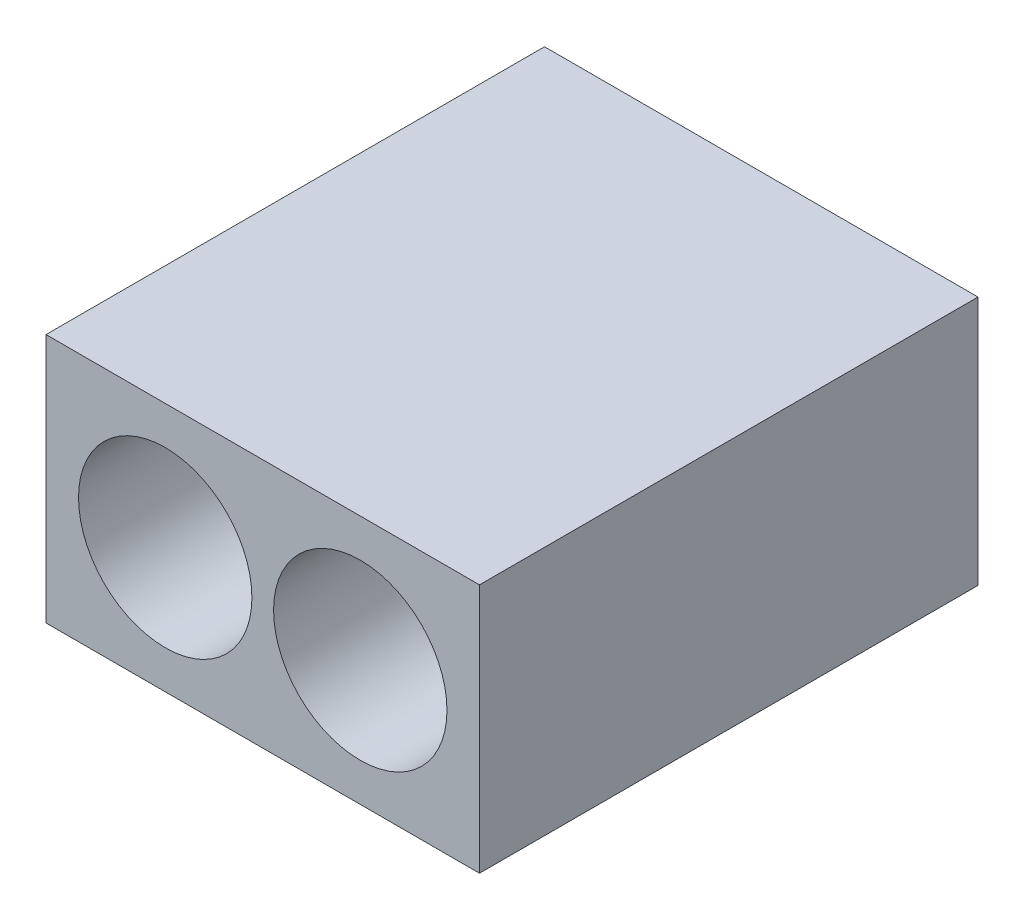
ISO-10303-21;
HEADER;
FILE_DESCRIPTION(('STEP AP214'),'2;1');
FILE_NAME('part.step','',(''),(''),'','','');
FILE_SCHEMA(('AUTOMOTIVE_DESIGN { 1 0 10303 214 1 1 1 1 }'));
ENDSEC;
DATA;
#1=APPLICATION_CONTEXT('core data for automotive mechanical design processes');
#2=APPLICATION_PROTOCOL_DEFINITION('international standard','automotive_design',2000,#1);
#3=PRODUCT_CONTEXT('',#1,'mechanical');
#4=PRODUCT('Part','Part','',(#3));
#5=PRODUCT_RELATED_PRODUCT_CATEGORY('part','',(#4));
#6=PRODUCT_DEFINITION_FORMATION('','',#4);
#7=PRODUCT_DEFINITION_CONTEXT('part definition',#1,'design');
#8=PRODUCT_DEFINITION('design','',#6,#7);
#9=PRODUCT_DEFINITION_SHAPE('','',#8);
#10=(LENGTH_UNIT() NAMED_UNIT(*) SI_UNIT(.MILLI.,.METRE.));
#11=(NAMED_UNIT(*) PLANE_ANGLE_UNIT() SI_UNIT($,.RADIAN.));
#12=(NAMED_UNIT(*) SI_UNIT($,.STERADIAN.) SOLID_ANGLE_UNIT());
#13=UNCERTAINTY_MEASURE_WITH_UNIT(LENGTH_MEASURE(1.E-05),#10,'distance_accuracy_value','');
#14=(GEOMETRIC_REPRESENTATION_CONTEXT(3) GLOBAL_UNCERTAINTY_ASSIGNED_CONTEXT((#13)) GLOBAL_UNIT_ASSIGNED_CONTEXT((#10,
#11,#12)) REPRESENTATION_CONTEXT('',''));
#15=CARTESIAN_POINT('',(0.,0.,0.));
#16=DIRECTION('',(0.,0.,1.));
#17=DIRECTION('',(1.,0.,0.));
#18=AXIS2_PLACEMENT_3D('',#15,#16,#17);
#19=CARTESIAN_POINT('',(10.,-5.762,23.));
#20=DIRECTION('',(-1.,0.,0.));
#21=DIRECTION('',(0.,0.,1.));
#22=AXIS2_PLACEMENT_3D('',#19,#20,#21);
#23=PLANE('',#22);
#24=DIRECTION('',(0.,1.,0.));
#25=VECTOR('',#24,1.);
#26=CARTESIAN_POINT('',(10.,-5.762,0.));
#27=LINE('',#26,#25);
#28=CARTESIAN_POINT('',(10.,-5.762,0.));
#29=VERTEX_POINT('',#28);
#30=CARTESIAN_POINT('',(10.,5.762,0.));
#31=VERTEX_POINT('',#30);
#32=EDGE_CURVE('E97',#29,#31,#27,.T.);
#33=ORIENTED_EDGE('',*,*,#32,.T.);
#34=DIRECTION('',(0.,0.,-1.));
#35=VECTOR('',#34,1.);
#36=CARTESIAN_POINT('',(10.,5.762,23.));
#37=LINE('',#36,#35);
#38=CARTESIAN_POINT('',(10.,5.762,23.));
#39=VERTEX_POINT('',#38);
#40=EDGE_CURVE('E11',#39,#31,#37,.T.);
#41=ORIENTED_EDGE('',*,*,#40,.F.);
#42=DIRECTION('',(0.,1.,0.));
#43=VECTOR('',#42,1.);
#44=CARTESIAN_POINT('',(10.,-5.762,23.));
#45=LINE('',#44,#43);
#46=CARTESIAN_POINT('',(10.,-5.762,23.));
#47=VERTEX_POINT('',#46);
#48=EDGE_CURVE('E85',#47,#39,#45,.T.);
#49=ORIENTED_EDGE('',*,*,#48,.F.);
#50=DIRECTION('',(0.,0.,-1.));
#51=VECTOR('',#50,1.);
#52=CARTESIAN_POINT('',(10.,-5.762,23.));
#53=LINE('',#52,#51);
#54=EDGE_CURVE('E93',#47,#29,#53,.T.);
#55=ORIENTED_EDGE('',*,*,#54,.T.);
#56=EDGE_LOOP('',(#33,#41,#49,#55));
#57=FACE_BOUND('',#56,.T.);
#58=ADVANCED_FACE('F34',(#57),#23,.F.);
#59=CARTESIAN_POINT('',(-10.,5.762,23.));
#60=DIRECTION('',(0.,-1.,0.));
#61=DIRECTION('',(0.,0.,-1.));
#62=AXIS2_PLACEMENT_3D('',#59,#60,#61);
#63=PLANE('',#62);
#64=DIRECTION('',(-1.,0.,0.));
#65=VECTOR('',#64,1.);
#66=CARTESIAN_POINT('',(-10.,5.762,0.));
#67=LINE('',#66,#65);
#68=CARTESIAN_POINT('',(-10.,5.762,0.));
#69=VERTEX_POINT('',#68);
#70=EDGE_CURVE('E89',#31,#69,#67,.T.);
#71=ORIENTED_EDGE('',*,*,#70,.T.);
#72=DIRECTION('',(0.,0.,-1.));
#73=VECTOR('',#72,1.);
#74=CARTESIAN_POINT('',(-10.,5.762,23.));
#75=LINE('',#74,#73);
#76=CARTESIAN_POINT('',(-10.,5.762,23.));
#77=VERTEX_POINT('',#76);
#78=EDGE_CURVE('E42',#77,#69,#75,.T.);
#79=ORIENTED_EDGE('',*,*,#78,.F.);
#80=DIRECTION('',(-1.,0.,0.));
#81=VECTOR('',#80,1.);
#82=CARTESIAN_POINT('',(-10.,5.762,23.));
#83=LINE('',#82,#81);
#84=EDGE_CURVE('E80',#39,#77,#83,.T.);
#85=ORIENTED_EDGE('',*,*,#84,.F.);
#86=ORIENTED_EDGE('',*,*,#40,.T.);
#87=EDGE_LOOP('',(#71,#79,#85,#86));
#88=FACE_BOUND('',#87,.T.);
#89=ADVANCED_FACE('F88',(#88),#63,.F.);
#90=CARTESIAN_POINT('',(-10.,-5.762,23.));
#91=DIRECTION('',(1.,0.,0.));
#92=DIRECTION('',(0.,0.,-1.));
#93=AXIS2_PLACEMENT_3D('',#90,#91,#92);
#94=PLANE('',#93);
#95=DIRECTION('',(0.,-1.,0.));
#96=VECTOR('',#95,1.);
#97=CARTESIAN_POINT('',(-10.,-5.762,0.));
#98=LINE('',#97,#96);
#99=CARTESIAN_POINT('',(-10.,-5.762,0.));
#100=VERTEX_POINT('',#99);
#101=EDGE_CURVE('E67',#69,#100,#98,.T.);
#102=ORIENTED_EDGE('',*,*,#101,.T.);
#103=DIRECTION('',(0.,0.,-1.));
#104=VECTOR('',#103,1.);
#105=CARTESIAN_POINT('',(-10.,-5.762,23.));
#106=LINE('',#105,#104);
#107=CARTESIAN_POINT('',(-10.,-5.762,23.));
#108=VERTEX_POINT('',#107);
#109=EDGE_CURVE('E90',#108,#100,#106,.T.);
#110=ORIENTED_EDGE('',*,*,#109,.F.);
#111=DIRECTION('',(0.,-1.,0.));
#112=VECTOR('',#111,1.);
#113=CARTESIAN_POINT('',(-10.,-5.762,23.));
#114=LINE('',#113,#112);
#115=EDGE_CURVE('E83',#77,#108,#114,.T.);
#116=ORIENTED_EDGE('',*,*,#115,.F.);
#117=ORIENTED_EDGE('',*,*,#78,.T.);
#118=EDGE_LOOP('',(#102,#110,#116,#117));
#119=FACE_BOUND('',#118,.T.);
#120=ADVANCED_FACE('F91',(#119),#94,.F.);
#121=CARTESIAN_POINT('',(-10.,-5.762,23.));
#122=DIRECTION('',(0.,1.,0.));
#123=DIRECTION('',(0.,0.,1.));
#124=AXIS2_PLACEMENT_3D('',#121,#122,#123);
#125=PLANE('',#124);
#126=DIRECTION('',(1.,0.,0.));
#127=VECTOR('',#126,1.);
#128=CARTESIAN_POINT('',(-10.,-5.762,0.));
#129=LINE('',#128,#127);
#130=EDGE_CURVE('E73',#100,#29,#129,.T.);
#131=ORIENTED_EDGE('',*,*,#130,.T.);
#132=ORIENTED_EDGE('',*,*,#54,.F.);
#133=DIRECTION('',(1.,0.,0.));
#134=VECTOR('',#133,1.);
#135=CARTESIAN_POINT('',(-10.,-5.762,23.));
#136=LINE('',#135,#134);
#137=EDGE_CURVE('E50',#108,#47,#136,.T.);
#138=ORIENTED_EDGE('',*,*,#137,.F.);
#139=ORIENTED_EDGE('',*,*,#109,.T.);
#140=EDGE_LOOP('',(#131,#132,#138,#139));
#141=FACE_BOUND('',#140,.T.);
#142=ADVANCED_FACE('F105',(#141),#125,.F.);
#143=CARTESIAN_POINT('',(0.,0.,23.));
#144=DIRECTION('',(0.,0.,-1.));
#145=DIRECTION('',(-1.,0.,0.));
#146=AXIS2_PLACEMENT_3D('',#143,#144,#145);
#147=PLANE('',#146);
#148=CARTESIAN_POINT('',(-4.5,0.,23.));
#149=DIRECTION('',(0.,0.,1.));
#150=DIRECTION('',(1.,0.,0.));
#151=AXIS2_PLACEMENT_3D('',#148,#149,#150);
#152=CIRCLE('',#151,3.99999999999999);
#153=CARTESIAN_POINT('',(-0.500000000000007,0.,23.));
#154=VERTEX_POINT('',#153);
#155=EDGE_CURVE('E131',#154,#154,#152,.T.);
#156=ORIENTED_EDGE('',*,*,#155,.F.);
#157=EDGE_LOOP('',(#156));
#158=FACE_BOUND('',#157,.T.);
#159=CARTESIAN_POINT('',(4.5,0.,23.));
#160=DIRECTION('',(0.,0.,1.));
#161=DIRECTION('',(1.,0.,0.));
#162=AXIS2_PLACEMENT_3D('',#159,#160,#161);
#163=CIRCLE('',#162,3.99999999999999);
#164=CARTESIAN_POINT('',(8.49999999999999,0.,23.));
#165=VERTEX_POINT('',#164);
#166=EDGE_CURVE('E119',#165,#165,#163,.T.);
#167=ORIENTED_EDGE('',*,*,#166,.F.);
#168=EDGE_LOOP('',(#167));
#169=FACE_BOUND('',#168,.T.);
#170=ORIENTED_EDGE('',*,*,#48,.T.);
#171=ORIENTED_EDGE('',*,*,#84,.T.);
#172=ORIENTED_EDGE('',*,*,#115,.T.);
#173=ORIENTED_EDGE('',*,*,#137,.T.);
#174=EDGE_LOOP('',(#170,#171,#172,#173));
#175=FACE_BOUND('',#174,.T.);
#176=ADVANCED_FACE('F81',(#158,#169,#175),#147,.F.);
#177=CARTESIAN_POINT('',(0.,0.,0.));
#178=DIRECTION('',(0.,0.,-1.));
#179=DIRECTION('',(-1.,0.,0.));
#180=AXIS2_PLACEMENT_3D('',#177,#178,#179);
#181=PLANE('',#180);
#182=CARTESIAN_POINT('',(-4.5,0.,0.));
#183=DIRECTION('',(0.,0.,1.));
#184=DIRECTION('',(1.,0.,0.));
#185=AXIS2_PLACEMENT_3D('',#182,#183,#184);
#186=CIRCLE('',#185,2.25);
#187=CARTESIAN_POINT('',(-2.25,0.,0.));
#188=VERTEX_POINT('',#187);
#189=EDGE_CURVE('E122',#188,#188,#186,.T.);
#190=ORIENTED_EDGE('',*,*,#189,.T.);
#191=EDGE_LOOP('',(#190));
#192=FACE_BOUND('',#191,.T.);
#193=CARTESIAN_POINT('',(4.5,0.,0.));
#194=DIRECTION('',(0.,0.,1.));
#195=DIRECTION('',(1.,0.,0.));
#196=AXIS2_PLACEMENT_3D('',#193,#194,#195);
#197=CIRCLE('',#196,2.25);
#198=CARTESIAN_POINT('',(6.75,0.,0.));
#199=VERTEX_POINT('',#198);
#200=EDGE_CURVE('E100',#199,#199,#197,.T.);
#201=ORIENTED_EDGE('',*,*,#200,.T.);
#202=EDGE_LOOP('',(#201));
#203=FACE_BOUND('',#202,.T.);
#204=ORIENTED_EDGE('',*,*,#32,.F.);
#205=ORIENTED_EDGE('',*,*,#130,.F.);
#206=ORIENTED_EDGE('',*,*,#101,.F.);
#207=ORIENTED_EDGE('',*,*,#70,.F.);
#208=EDGE_LOOP('',(#204,#205,#206,#207));
#209=FACE_BOUND('',#208,.T.);
#210=ADVANCED_FACE('F108',(#192,#203,#209),#181,.T.);
#211=CARTESIAN_POINT('',(4.5,0.,23.));
#212=DIRECTION('',(0.,0.,1.));
#213=DIRECTION('',(1.,0.,0.));
#214=AXIS2_PLACEMENT_3D('',#211,#212,#213);
#215=CYLINDRICAL_SURFACE('',#214,2.25);
#216=ORIENTED_EDGE('',*,*,#200,.F.);
#217=EDGE_LOOP('',(#216));
#218=FACE_BOUND('',#217,.T.);
#219=CARTESIAN_POINT('',(4.5,0.,14.));
#220=DIRECTION('',(0.,0.,1.));
#221=DIRECTION('',(1.,0.,0.));
#222=AXIS2_PLACEMENT_3D('',#219,#220,#221);
#223=CIRCLE('',#222,2.25);
#224=CARTESIAN_POINT('',(6.75,0.,14.));
#225=VERTEX_POINT('',#224);
#226=EDGE_CURVE('E113',#225,#225,#223,.T.);
#227=ORIENTED_EDGE('',*,*,#226,.T.);
#228=EDGE_LOOP('',(#227));
#229=FACE_BOUND('',#228,.T.);
#230=ADVANCED_FACE('F155',(#218,#229),#215,.F.);
#231=CARTESIAN_POINT('',(6.75,0.,14.));
#232=DIRECTION('',(0.,0.,-1.));
#233=DIRECTION('',(-1.,0.,0.));
#234=AXIS2_PLACEMENT_3D('',#231,#232,#233);
#235=PLANE('',#234);
#236=ORIENTED_EDGE('',*,*,#226,.F.);
#237=EDGE_LOOP('',(#236));
#238=FACE_BOUND('',#237,.T.);
#239=CARTESIAN_POINT('',(4.5,0.,14.));
#240=DIRECTION('',(0.,0.,1.));
#241=DIRECTION('',(1.,0.,0.));
#242=AXIS2_PLACEMENT_3D('',#239,#240,#241);
#243=CIRCLE('',#242,4.);
#244=CARTESIAN_POINT('',(8.5,0.,14.));
#245=VERTEX_POINT('',#244);
#246=EDGE_CURVE('E116',#245,#245,#243,.T.);
#247=ORIENTED_EDGE('',*,*,#246,.T.);
#248=EDGE_LOOP('',(#247));
#249=FACE_BOUND('',#248,.T.);
#250=ADVANCED_FACE('F145',(#238,#249),#235,.F.);
#251=CARTESIAN_POINT('',(4.5,0.,23.));
#252=DIRECTION('',(0.,0.,1.));
#253=DIRECTION('',(1.,0.,0.));
#254=AXIS2_PLACEMENT_3D('',#251,#252,#253);
#255=CYLINDRICAL_SURFACE('',#254,4.);
#256=ORIENTED_EDGE('',*,*,#246,.F.);
#257=EDGE_LOOP('',(#256));
#258=FACE_BOUND('',#257,.T.);
#259=ORIENTED_EDGE('',*,*,#166,.T.);
#260=EDGE_LOOP('',(#259));
#261=FACE_BOUND('',#260,.T.);
#262=ADVANCED_FACE('F142',(#258,#261),#255,.F.);
#263=CARTESIAN_POINT('',(-4.5,0.,23.));
#264=DIRECTION('',(0.,0.,1.));
#265=DIRECTION('',(1.,0.,0.));
#266=AXIS2_PLACEMENT_3D('',#263,#264,#265);
#267=CYLINDRICAL_SURFACE('',#266,2.25);
#268=ORIENTED_EDGE('',*,*,#189,.F.);
#269=EDGE_LOOP('',(#268));
#270=FACE_BOUND('',#269,.T.);
#271=CARTESIAN_POINT('',(-4.5,0.,14.));
#272=DIRECTION('',(0.,0.,1.));
#273=DIRECTION('',(1.,0.,0.));
#274=AXIS2_PLACEMENT_3D('',#271,#272,#273);
#275=CIRCLE('',#274,2.25);
#276=CARTESIAN_POINT('',(-2.25,0.,14.));
#277=VERTEX_POINT('',#276);
#278=EDGE_CURVE('E125',#277,#277,#275,.T.);
#279=ORIENTED_EDGE('',*,*,#278,.T.);
#280=EDGE_LOOP('',(#279));
#281=FACE_BOUND('',#280,.T.);
#282=ADVANCED_FACE('F144',(#270,#281),#267,.F.);
#283=CARTESIAN_POINT('',(-2.25,0.,14.));
#284=DIRECTION('',(0.,0.,-1.));
#285=DIRECTION('',(-1.,0.,0.));
#286=AXIS2_PLACEMENT_3D('',#283,#284,#285);
#287=PLANE('',#286);
#288=ORIENTED_EDGE('',*,*,#278,.F.);
#289=EDGE_LOOP('',(#288));
#290=FACE_BOUND('',#289,.T.);
#291=CARTESIAN_POINT('',(-4.5,0.,14.));
#292=DIRECTION('',(0.,0.,1.));
#293=DIRECTION('',(1.,0.,0.));
#294=AXIS2_PLACEMENT_3D('',#291,#292,#293);
#295=CIRCLE('',#294,4.);
#296=CARTESIAN_POINT('',(-0.500000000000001,0.,14.));
#297=VERTEX_POINT('',#296);
#298=EDGE_CURVE('E128',#297,#297,#295,.T.);
#299=ORIENTED_EDGE('',*,*,#298,.T.);
#300=EDGE_LOOP('',(#299));
#301=FACE_BOUND('',#300,.T.);
#302=ADVANCED_FACE('F152',(#290,#301),#287,.F.);
#303=CARTESIAN_POINT('',(-4.5,0.,23.));
#304=DIRECTION('',(0.,0.,1.));
#305=DIRECTION('',(1.,0.,0.));
#306=AXIS2_PLACEMENT_3D('',#303,#304,#305);
#307=CYLINDRICAL_SURFACE('',#306,4.);
#308=ORIENTED_EDGE('',*,*,#298,.F.);
#309=EDGE_LOOP('',(#308));
#310=FACE_BOUND('',#309,.T.);
#311=ORIENTED_EDGE('',*,*,#155,.T.);
#312=EDGE_LOOP('',(#311));
#313=FACE_BOUND('',#312,.T.);
#314=ADVANCED_FACE('F135',(#310,#313),#307,.F.);
#315=CLOSED_SHELL('',(#58,#89,#120,#142,#176,#210,#230,#250,#262,#282,#302,#314));
#316=MANIFOLD_SOLID_BREP('B2',#315);
#317=ADVANCED_BREP_SHAPE_REPRESENTATION('',(#18,#316),#14);
#318=SHAPE_DEFINITION_REPRESENTATION(#9,#317);
ENDSEC;
END-ISO-10303-21;
